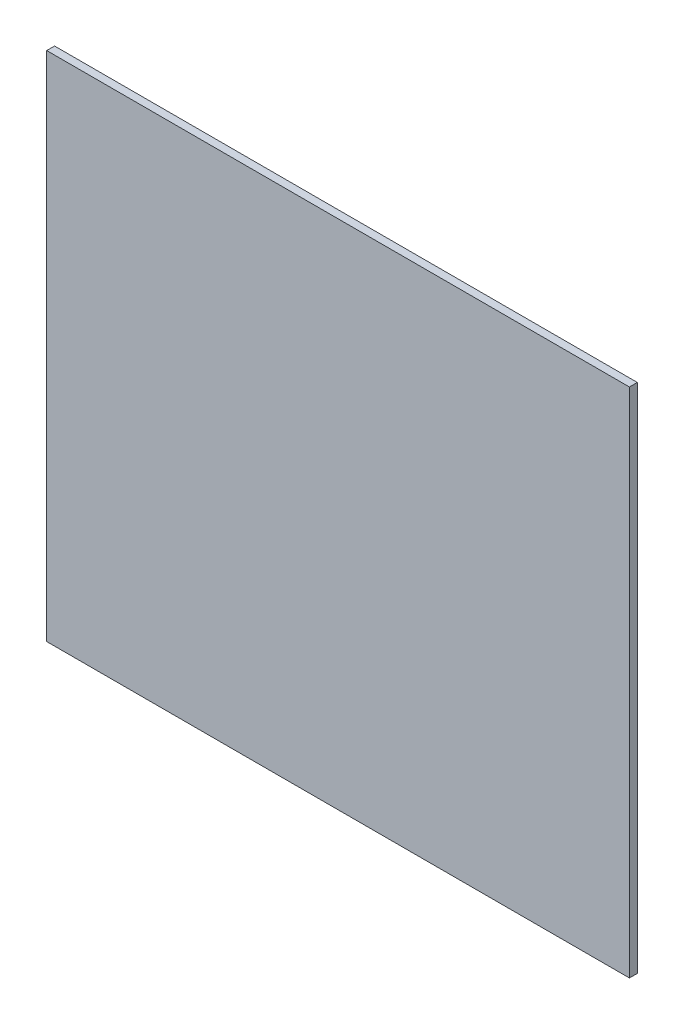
from build123d import *

# Parameters (mm, degrees)
SKETCH1_W      = 939.8
SKETCH1_H      = 825.5
EXTRUDE1_DEPTH = 6.35


with BuildPart() as part:
    # Sketch1 → Extrude1 (new, symmetric)
    with BuildSketch(Plane.XY):
        Rectangle(SKETCH1_W, SKETCH1_H)
    extrude(amount=EXTRUDE1_DEPTH, both=True)


solid = part.part
